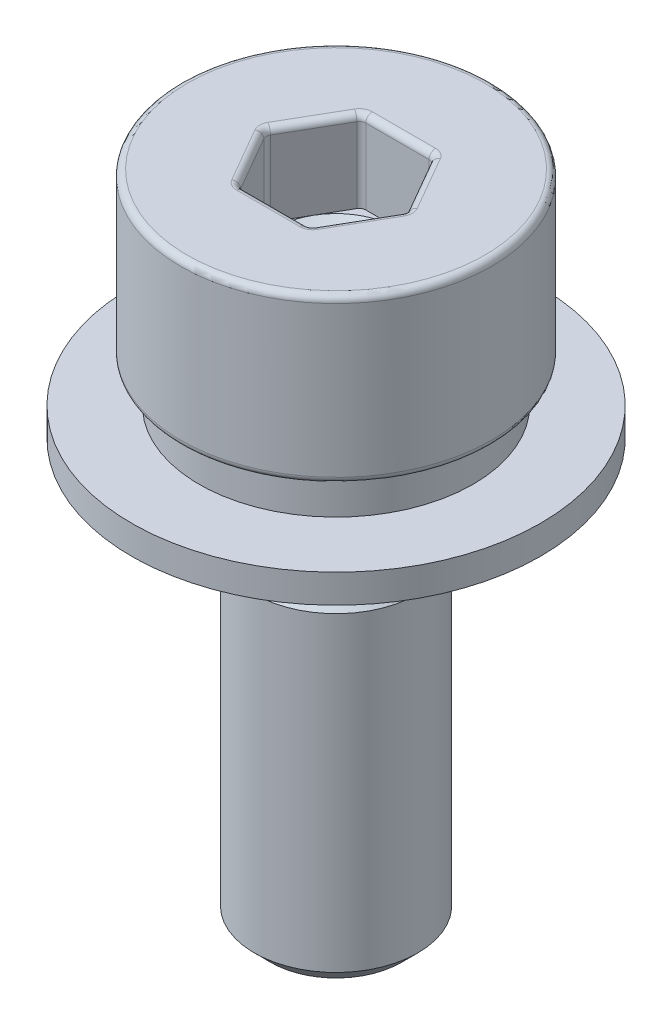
ISO-10303-21;
HEADER;
FILE_DESCRIPTION(('STEP AP214'),'2;1');
FILE_NAME('part.step','',(''),(''),'','','');
FILE_SCHEMA(('AUTOMOTIVE_DESIGN { 1 0 10303 214 1 1 1 1 }'));
ENDSEC;
DATA;
#1=APPLICATION_CONTEXT('core data for automotive mechanical design processes');
#2=APPLICATION_PROTOCOL_DEFINITION('international standard','automotive_design',2000,#1);
#3=PRODUCT_CONTEXT('',#1,'mechanical');
#4=PRODUCT('Part','Part','',(#3));
#5=PRODUCT_RELATED_PRODUCT_CATEGORY('part','',(#4));
#6=PRODUCT_DEFINITION_FORMATION('','',#4);
#7=PRODUCT_DEFINITION_CONTEXT('part definition',#1,'design');
#8=PRODUCT_DEFINITION('design','',#6,#7);
#9=PRODUCT_DEFINITION_SHAPE('','',#8);
#10=(LENGTH_UNIT() NAMED_UNIT(*) SI_UNIT(.MILLI.,.METRE.));
#11=(NAMED_UNIT(*) PLANE_ANGLE_UNIT() SI_UNIT($,.RADIAN.));
#12=(NAMED_UNIT(*) SI_UNIT($,.STERADIAN.) SOLID_ANGLE_UNIT());
#13=UNCERTAINTY_MEASURE_WITH_UNIT(LENGTH_MEASURE(1.E-05),#10,'distance_accuracy_value','');
#14=(GEOMETRIC_REPRESENTATION_CONTEXT(3) GLOBAL_UNCERTAINTY_ASSIGNED_CONTEXT((#13)) GLOBAL_UNIT_ASSIGNED_CONTEXT((#10,
#11,#12)) REPRESENTATION_CONTEXT('',''));
#15=CARTESIAN_POINT('',(0.,0.,0.));
#16=DIRECTION('',(0.,0.,1.));
#17=DIRECTION('',(1.,0.,0.));
#18=AXIS2_PLACEMENT_3D('',#15,#16,#17);
#19=CARTESIAN_POINT('',(1.9,-2.,0.));
#20=DIRECTION('',(0.,-1.,0.));
#21=DIRECTION('',(1.,0.,0.));
#22=AXIS2_PLACEMENT_3D('',#19,#20,#21);
#23=PLANE('',#22);
#24=CARTESIAN_POINT('',(0.,-2.00000000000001,0.));
#25=DIRECTION('',(0.,-1.,0.));
#26=DIRECTION('',(1.,0.,0.));
#27=AXIS2_PLACEMENT_3D('',#24,#25,#26);
#28=CIRCLE('',#27,1.82);
#29=CARTESIAN_POINT('',(1.82,-2.,0.));
#30=VERTEX_POINT('',#29);
#31=EDGE_CURVE('E354',#30,#30,#28,.T.);
#32=ORIENTED_EDGE('',*,*,#31,.T.);
#33=EDGE_LOOP('',(#32));
#34=FACE_BOUND('',#33,.T.);
#35=DIRECTION('',(1.,0.,0.));
#36=VECTOR('',#35,1.);
#37=CARTESIAN_POINT('',(-1.9,-2.,0.0461753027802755));
#38=LINE('',#37,#36);
#39=CARTESIAN_POINT('',(-1.67436341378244,-2.00000000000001,0.0461753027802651));
#40=VERTEX_POINT('',#39);
#41=CARTESIAN_POINT('',(-0.873780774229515,-2.,0.0461753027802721));
#42=VERTEX_POINT('',#41);
#43=EDGE_CURVE('E647',#40,#42,#38,.T.);
#44=ORIENTED_EDGE('',*,*,#43,.F.);
#45=CARTESIAN_POINT('',(0.,-2.00000000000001,0.));
#46=DIRECTION('',(0.,-1.,0.));
#47=DIRECTION('',(1.,0.,0.));
#48=AXIS2_PLACEMENT_3D('',#45,#46,#47);
#49=CIRCLE('',#48,1.675);
#50=CARTESIAN_POINT('',(-1.66255240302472,-2.00000000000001,-0.203824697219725));
#51=VERTEX_POINT('',#50);
#52=EDGE_CURVE('E223',#51,#40,#49,.T.);
#53=ORIENTED_EDGE('',*,*,#52,.F.);
#54=DIRECTION('',(1.,0.,0.));
#55=VECTOR('',#54,1.);
#56=CARTESIAN_POINT('',(-1.9,-2.00000000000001,-0.203824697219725));
#57=LINE('',#56,#55);
#58=CARTESIAN_POINT('',(-0.850929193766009,-2.,-0.203824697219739));
#59=VERTEX_POINT('',#58);
#60=EDGE_CURVE('E650',#51,#59,#57,.T.);
#61=ORIENTED_EDGE('',*,*,#60,.T.);
#62=CARTESIAN_POINT('',(0.,-2.00000000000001,0.));
#63=DIRECTION('',(0.,-1.,0.));
#64=DIRECTION('',(1.,0.,0.));
#65=AXIS2_PLACEMENT_3D('',#62,#63,#64);
#66=CIRCLE('',#65,0.875);
#67=EDGE_CURVE('E13',#42,#59,#66,.F.);
#68=ORIENTED_EDGE('',*,*,#67,.F.);
#69=EDGE_LOOP('',(#44,#53,#61,#68));
#70=FACE_BOUND('',#69,.T.);
#71=CARTESIAN_POINT('',(0.,-2.,0.));
#72=DIRECTION('',(0.,-1.,0.));
#73=DIRECTION('',(1.,0.,0.));
#74=AXIS2_PLACEMENT_3D('',#71,#72,#73);
#75=CIRCLE('',#74,0.799999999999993);
#76=CARTESIAN_POINT('',(0.799999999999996,-2.,0.));
#77=VERTEX_POINT('',#76);
#78=EDGE_CURVE('E271',#77,#77,#75,.T.);
#79=ORIENTED_EDGE('',*,*,#78,.F.);
#80=EDGE_LOOP('',(#79));
#81=FACE_BOUND('',#80,.T.);
#82=ADVANCED_FACE('F45',(#34,#70,#81),#23,.T.);
#83=CARTESIAN_POINT('',(2.42861286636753E-13,-71.2230936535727,0.));
#84=DIRECTION('',(0.,-1.,0.));
#85=DIRECTION('',(1.,0.,0.));
#86=AXIS2_PLACEMENT_3D('',#83,#84,#85);
#87=CYLINDRICAL_SURFACE('',#86,1.9);
#88=CARTESIAN_POINT('',(0.,-0.0799999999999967,0.));
#89=DIRECTION('',(0.,1.,0.));
#90=DIRECTION('',(-1.,0.,0.));
#91=AXIS2_PLACEMENT_3D('',#88,#89,#90);
#92=CIRCLE('',#91,1.9);
#93=CARTESIAN_POINT('',(-1.9,-0.0800000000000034,0.));
#94=VERTEX_POINT('',#93);
#95=EDGE_CURVE('E351',#94,#94,#92,.F.);
#96=ORIENTED_EDGE('',*,*,#95,.T.);
#97=EDGE_LOOP('',(#96));
#98=FACE_BOUND('',#97,.T.);
#99=CARTESIAN_POINT('',(0.,-1.92000000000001,0.));
#100=DIRECTION('',(0.,-1.,0.));
#101=DIRECTION('',(1.,0.,0.));
#102=AXIS2_PLACEMENT_3D('',#99,#100,#101);
#103=CIRCLE('',#102,1.9);
#104=CARTESIAN_POINT('',(1.9,-1.92,0.));
#105=VERTEX_POINT('',#104);
#106=EDGE_CURVE('E348',#105,#105,#103,.F.);
#107=ORIENTED_EDGE('',*,*,#106,.T.);
#108=EDGE_LOOP('',(#107));
#109=FACE_BOUND('',#108,.T.);
#110=ADVANCED_FACE('F442',(#98,#109),#87,.T.);
#111=CARTESIAN_POINT('',(0.749999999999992,0.,0.));
#112=DIRECTION('',(0.,1.,0.));
#113=DIRECTION('',(-1.,0.,0.));
#114=AXIS2_PLACEMENT_3D('',#111,#112,#113);
#115=PLANE('',#114);
#116=CARTESIAN_POINT('',(0.386824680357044,0.,-0.669999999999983));
#117=DIRECTION('',(0.,1.,0.));
#118=DIRECTION('',(-1.,0.,0.));
#119=AXIS2_PLACEMENT_3D('',#116,#117,#118);
#120=CIRCLE('',#119,0.16);
#121=CARTESIAN_POINT('',(0.52538874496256,0.,-0.749999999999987));
#122=VERTEX_POINT('',#121);
#123=CARTESIAN_POINT('',(0.386824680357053,0.,-0.829999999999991));
#124=VERTEX_POINT('',#123);
#125=EDGE_CURVE('E311',#122,#124,#120,.T.);
#126=ORIENTED_EDGE('',*,*,#125,.F.);
#127=DIRECTION('',(-0.5,0.,-0.866025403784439));
#128=VECTOR('',#127,1.);
#129=CARTESIAN_POINT('',(0.93530743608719,0.,-0.0399999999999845));
#130=LINE('',#129,#128);
#131=CARTESIAN_POINT('',(0.912213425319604,0.,-0.0799999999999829));
#132=VERTEX_POINT('',#131);
#133=EDGE_CURVE('E317',#122,#132,#130,.F.);
#134=ORIENTED_EDGE('',*,*,#133,.T.);
#135=CARTESIAN_POINT('',(0.773649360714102,0.,0.));
#136=DIRECTION('',(0.,1.,0.));
#137=DIRECTION('',(-1.,0.,0.));
#138=AXIS2_PLACEMENT_3D('',#135,#136,#137);
#139=CIRCLE('',#138,0.16);
#140=CARTESIAN_POINT('',(0.912213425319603,0.,0.0800000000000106));
#141=VERTEX_POINT('',#140);
#142=EDGE_CURVE('E314',#141,#132,#139,.T.);
#143=ORIENTED_EDGE('',*,*,#142,.F.);
#144=DIRECTION('',(0.500000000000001,0.,-0.86602540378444));
#145=VECTOR('',#144,1.);
#146=CARTESIAN_POINT('',(0.502294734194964,0.,0.790000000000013));
#147=LINE('',#146,#145);
#148=CARTESIAN_POINT('',(0.525388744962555,0.,0.750000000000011));
#149=VERTEX_POINT('',#148);
#150=EDGE_CURVE('E309',#141,#149,#147,.F.);
#151=ORIENTED_EDGE('',*,*,#150,.T.);
#152=CARTESIAN_POINT('',(0.386824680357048,0.,0.670000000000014));
#153=DIRECTION('',(0.,1.,0.));
#154=DIRECTION('',(-1.,0.,0.));
#155=AXIS2_PLACEMENT_3D('',#152,#153,#154);
#156=CIRCLE('',#155,0.16);
#157=CARTESIAN_POINT('',(0.386824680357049,0.,0.829999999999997));
#158=VERTEX_POINT('',#157);
#159=EDGE_CURVE('E306',#158,#149,#156,.T.);
#160=ORIENTED_EDGE('',*,*,#159,.F.);
#161=DIRECTION('',(1.,0.,0.));
#162=VECTOR('',#161,1.);
#163=CARTESIAN_POINT('',(-0.433012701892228,0.,0.830000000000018));
#164=LINE('',#163,#162);
#165=CARTESIAN_POINT('',(-0.386824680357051,0.,0.830000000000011));
#166=VERTEX_POINT('',#165);
#167=EDGE_CURVE('E298',#158,#166,#164,.F.);
#168=ORIENTED_EDGE('',*,*,#167,.T.);
#169=CARTESIAN_POINT('',(-0.386824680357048,0.,0.670000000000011));
#170=DIRECTION('',(0.,1.,0.));
#171=DIRECTION('',(-1.,0.,0.));
#172=AXIS2_PLACEMENT_3D('',#169,#170,#171);
#173=CIRCLE('',#172,0.16);
#174=CARTESIAN_POINT('',(-0.525388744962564,0.,0.750000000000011));
#175=VERTEX_POINT('',#174);
#176=EDGE_CURVE('E295',#175,#166,#173,.T.);
#177=ORIENTED_EDGE('',*,*,#176,.F.);
#178=DIRECTION('',(0.500000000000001,0.,0.866025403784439));
#179=VECTOR('',#178,1.);
#180=CARTESIAN_POINT('',(-0.935307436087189,0.,0.0400000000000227));
#181=LINE('',#180,#179);
#182=CARTESIAN_POINT('',(-0.912213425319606,0.,0.0800000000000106));
#183=VERTEX_POINT('',#182);
#184=EDGE_CURVE('E291',#175,#183,#181,.F.);
#185=ORIENTED_EDGE('',*,*,#184,.T.);
#186=CARTESIAN_POINT('',(-0.773649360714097,0.,0.));
#187=DIRECTION('',(0.,1.,0.));
#188=DIRECTION('',(-1.,0.,0.));
#189=AXIS2_PLACEMENT_3D('',#186,#187,#188);
#190=CIRCLE('',#189,0.16);
#191=CARTESIAN_POINT('',(-0.912213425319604,0.,-0.0799999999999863));
#192=VERTEX_POINT('',#191);
#193=EDGE_CURVE('E288',#192,#183,#190,.T.);
#194=ORIENTED_EDGE('',*,*,#193,.F.);
#195=DIRECTION('',(-0.500000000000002,0.,0.86602540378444));
#196=VECTOR('',#195,1.);
#197=CARTESIAN_POINT('',(-0.502294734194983,0.,-0.789999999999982));
#198=LINE('',#197,#196);
#199=CARTESIAN_POINT('',(-0.525388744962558,0.,-0.74999999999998));
#200=VERTEX_POINT('',#199);
#201=EDGE_CURVE('E293',#192,#200,#198,.F.);
#202=ORIENTED_EDGE('',*,*,#201,.T.);
#203=CARTESIAN_POINT('',(-0.386824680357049,0.,-0.66999999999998));
#204=DIRECTION('',(0.,1.,0.));
#205=DIRECTION('',(-1.,0.,0.));
#206=AXIS2_PLACEMENT_3D('',#203,#204,#205);
#207=CIRCLE('',#206,0.16);
#208=CARTESIAN_POINT('',(-0.386824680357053,0.,-0.829999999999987));
#209=VERTEX_POINT('',#208);
#210=EDGE_CURVE('E301',#209,#200,#207,.T.);
#211=ORIENTED_EDGE('',*,*,#210,.F.);
#212=DIRECTION('',(-1.,0.,0.));
#213=VECTOR('',#212,1.);
#214=CARTESIAN_POINT('',(0.433012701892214,0.,-0.829999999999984));
#215=LINE('',#214,#213);
#216=EDGE_CURVE('E304',#209,#124,#215,.F.);
#217=ORIENTED_EDGE('',*,*,#216,.T.);
#218=EDGE_LOOP('',(#126,#134,#143,#151,#160,#168,#177,#185,#194,#202,#211,#217));
#219=FACE_BOUND('',#218,.T.);
#220=CARTESIAN_POINT('',(0.,0.,0.));
#221=DIRECTION('',(0.,1.,0.));
#222=DIRECTION('',(-1.,0.,0.));
#223=AXIS2_PLACEMENT_3D('',#220,#221,#222);
#224=CIRCLE('',#223,1.82);
#225=CARTESIAN_POINT('',(-1.82,0.,0.));
#226=VERTEX_POINT('',#225);
#227=EDGE_CURVE('E285',#226,#226,#224,.T.);
#228=ORIENTED_EDGE('',*,*,#227,.T.);
#229=EDGE_LOOP('',(#228));
#230=FACE_BOUND('',#229,.T.);
#231=ADVANCED_FACE('F448',(#219,#230),#115,.T.);
#232=CARTESIAN_POINT('',(0.433012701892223,-1.,0.750000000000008));
#233=DIRECTION('',(0.86602540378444,0.,0.499999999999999));
#234=DIRECTION('',(0.500000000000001,0.,-0.86602540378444));
#235=AXIS2_PLACEMENT_3D('',#232,#233,#234);
#236=PLANE('',#235);
#237=DIRECTION('',(0.500000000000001,0.,-0.86602540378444));
#238=VECTOR('',#237,1.);
#239=CARTESIAN_POINT('',(0.433012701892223,-1.,0.750000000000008));
#240=LINE('',#239,#238);
#241=CARTESIAN_POINT('',(0.456106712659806,-1.,0.710000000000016));
#242=VERTEX_POINT('',#241);
#243=CARTESIAN_POINT('',(0.649519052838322,-0.999999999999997,0.375000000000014));
#244=VERTEX_POINT('',#243);
#245=EDGE_CURVE('E246',#242,#244,#240,.T.);
#246=ORIENTED_EDGE('',*,*,#245,.F.);
#247=DIRECTION('',(0.,1.,0.));
#248=VECTOR('',#247,1.);
#249=CARTESIAN_POINT('',(0.456106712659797,0.,0.710000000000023));
#250=LINE('',#249,#248);
#251=CARTESIAN_POINT('',(0.456106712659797,-0.0800000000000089,0.710000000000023));
#252=VERTEX_POINT('',#251);
#253=EDGE_CURVE('E323',#242,#252,#250,.T.);
#254=ORIENTED_EDGE('',*,*,#253,.T.);
#255=DIRECTION('',(0.500000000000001,0.,-0.86602540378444));
#256=VECTOR('',#255,1.);
#257=CARTESIAN_POINT('',(0.866025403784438,-0.0800000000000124,0.));
#258=LINE('',#257,#256);
#259=CARTESIAN_POINT('',(0.842931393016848,-0.0800000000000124,0.0400000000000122));
#260=VERTEX_POINT('',#259);
#261=EDGE_CURVE('E321',#252,#260,#258,.T.);
#262=ORIENTED_EDGE('',*,*,#261,.T.);
#263=DIRECTION('',(0.,1.,0.));
#264=VECTOR('',#263,1.);
#265=CARTESIAN_POINT('',(0.842931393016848,-1.00000000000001,0.0400000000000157));
#266=LINE('',#265,#264);
#267=CARTESIAN_POINT('',(0.842931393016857,-1.00000000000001,0.0400000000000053));
#268=VERTEX_POINT('',#267);
#269=EDGE_CURVE('E319',#260,#268,#266,.F.);
#270=ORIENTED_EDGE('',*,*,#269,.T.);
#271=EDGE_CURVE('E249',#244,#268,#240,.T.);
#272=ORIENTED_EDGE('',*,*,#271,.F.);
#273=EDGE_LOOP('',(#246,#254,#262,#270,#272));
#274=FACE_BOUND('',#273,.T.);
#275=ADVANCED_FACE('F563',(#274),#236,.F.);
#276=CARTESIAN_POINT('',(-0.433012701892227,-1.,0.750000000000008));
#277=DIRECTION('',(0.,0.,1.));
#278=DIRECTION('',(1.,0.,0.));
#279=AXIS2_PLACEMENT_3D('',#276,#277,#278);
#280=PLANE('',#279);
#281=DIRECTION('',(1.,0.,0.));
#282=VECTOR('',#281,1.);
#283=CARTESIAN_POINT('',(-0.433012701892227,-1.,0.750000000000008));
#284=LINE('',#283,#282);
#285=CARTESIAN_POINT('',(-0.386824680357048,-1.,0.750000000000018));
#286=VERTEX_POINT('',#285);
#287=CARTESIAN_POINT('',(0.,-0.999999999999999,0.750000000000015));
#288=VERTEX_POINT('',#287);
#289=EDGE_CURVE('E262',#286,#288,#284,.T.);
#290=ORIENTED_EDGE('',*,*,#289,.F.);
#291=DIRECTION('',(0.,1.,0.));
#292=VECTOR('',#291,1.);
#293=CARTESIAN_POINT('',(-0.386824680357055,0.,0.750000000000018));
#294=LINE('',#293,#292);
#295=CARTESIAN_POINT('',(-0.386824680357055,-0.0800000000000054,0.750000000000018));
#296=VERTEX_POINT('',#295);
#297=EDGE_CURVE('E283',#286,#296,#294,.T.);
#298=ORIENTED_EDGE('',*,*,#297,.T.);
#299=DIRECTION('',(1.,0.,0.));
#300=VECTOR('',#299,1.);
#301=CARTESIAN_POINT('',(0.433012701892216,-0.0800000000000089,0.750000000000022));
#302=LINE('',#301,#300);
#303=CARTESIAN_POINT('',(0.386824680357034,-0.0800000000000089,0.750000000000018));
#304=VERTEX_POINT('',#303);
#305=EDGE_CURVE('E280',#296,#304,#302,.T.);
#306=ORIENTED_EDGE('',*,*,#305,.T.);
#307=DIRECTION('',(0.,1.,0.));
#308=VECTOR('',#307,1.);
#309=CARTESIAN_POINT('',(0.386824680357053,-1.,0.749999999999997));
#310=LINE('',#309,#308);
#311=CARTESIAN_POINT('',(0.386824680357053,-1.,0.749999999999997));
#312=VERTEX_POINT('',#311);
#313=EDGE_CURVE('E278',#304,#312,#310,.F.);
#314=ORIENTED_EDGE('',*,*,#313,.T.);
#315=EDGE_CURVE('E261',#288,#312,#284,.T.);
#316=ORIENTED_EDGE('',*,*,#315,.F.);
#317=EDGE_LOOP('',(#290,#298,#306,#314,#316));
#318=FACE_BOUND('',#317,.T.);
#319=ADVANCED_FACE('F559',(#318),#280,.F.);
#320=CARTESIAN_POINT('',(-0.866025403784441,-0.999999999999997,0.));
#321=DIRECTION('',(-0.866025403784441,0.,0.500000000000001));
#322=DIRECTION('',(0.500000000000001,0.,0.866025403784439));
#323=AXIS2_PLACEMENT_3D('',#320,#321,#322);
#324=PLANE('',#323);
#325=DIRECTION('',(0.500000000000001,0.,0.866025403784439));
#326=VECTOR('',#325,1.);
#327=CARTESIAN_POINT('',(-0.866025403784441,-0.999999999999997,0.));
#328=LINE('',#327,#326);
#329=CARTESIAN_POINT('',(-0.842931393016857,-1.,0.0400000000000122));
#330=VERTEX_POINT('',#329);
#331=CARTESIAN_POINT('',(-0.64951905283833,-1.00000000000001,0.375000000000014));
#332=VERTEX_POINT('',#331);
#333=EDGE_CURVE('E259',#330,#332,#328,.T.);
#334=ORIENTED_EDGE('',*,*,#333,.F.);
#335=DIRECTION('',(0.,1.,0.));
#336=VECTOR('',#335,1.);
#337=CARTESIAN_POINT('',(-0.84293139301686,0.,0.0400000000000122));
#338=LINE('',#337,#336);
#339=CARTESIAN_POINT('',(-0.84293139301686,-0.0800000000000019,0.0400000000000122));
#340=VERTEX_POINT('',#339);
#341=EDGE_CURVE('E68',#330,#340,#338,.T.);
#342=ORIENTED_EDGE('',*,*,#341,.T.);
#343=DIRECTION('',(0.500000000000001,0.,0.866025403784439));
#344=VECTOR('',#343,1.);
#345=CARTESIAN_POINT('',(-0.43301270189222,-0.0800000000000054,0.749999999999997));
#346=LINE('',#345,#344);
#347=CARTESIAN_POINT('',(-0.456106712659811,-0.0800000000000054,0.710000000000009));
#348=VERTEX_POINT('',#347);
#349=EDGE_CURVE('E345',#340,#348,#346,.T.);
#350=ORIENTED_EDGE('',*,*,#349,.T.);
#351=DIRECTION('',(0.,1.,0.));
#352=VECTOR('',#351,1.);
#353=CARTESIAN_POINT('',(-0.456106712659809,-1.,0.710000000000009));
#354=LINE('',#353,#352);
#355=CARTESIAN_POINT('',(-0.456106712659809,-1.,0.710000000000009));
#356=VERTEX_POINT('',#355);
#357=EDGE_CURVE('E343',#348,#356,#354,.F.);
#358=ORIENTED_EDGE('',*,*,#357,.T.);
#359=EDGE_CURVE('E258',#332,#356,#328,.T.);
#360=ORIENTED_EDGE('',*,*,#359,.F.);
#361=EDGE_LOOP('',(#334,#342,#350,#358,#360));
#362=FACE_BOUND('',#361,.T.);
#363=ADVANCED_FACE('F562',(#362),#324,.F.);
#364=CARTESIAN_POINT('',(-0.433012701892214,-0.999999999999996,-0.74999999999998));
#365=DIRECTION('',(-0.86602540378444,0.,-0.5));
#366=DIRECTION('',(-0.500000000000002,0.,0.86602540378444));
#367=AXIS2_PLACEMENT_3D('',#364,#365,#366);
#368=PLANE('',#367);
#369=DIRECTION('',(-0.500000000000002,0.,0.86602540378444));
#370=VECTOR('',#369,1.);
#371=CARTESIAN_POINT('',(-0.866025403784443,-0.0800000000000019,0.));
#372=LINE('',#371,#370);
#373=CARTESIAN_POINT('',(-0.456106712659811,-0.0800000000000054,-0.709999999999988));
#374=VERTEX_POINT('',#373);
#375=CARTESIAN_POINT('',(-0.842931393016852,-0.0800000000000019,-0.0399999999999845));
#376=VERTEX_POINT('',#375);
#377=EDGE_CURVE('E339',#374,#376,#372,.T.);
#378=ORIENTED_EDGE('',*,*,#377,.T.);
#379=DIRECTION('',(0.,1.,0.));
#380=VECTOR('',#379,1.);
#381=CARTESIAN_POINT('',(-0.842931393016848,-1.,-0.0399999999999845));
#382=LINE('',#381,#380);
#383=CARTESIAN_POINT('',(-0.842931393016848,-1.,-0.0399999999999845));
#384=VERTEX_POINT('',#383);
#385=EDGE_CURVE('E341',#376,#384,#382,.F.);
#386=ORIENTED_EDGE('',*,*,#385,.T.);
#387=DIRECTION('',(-0.500000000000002,0.,0.86602540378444));
#388=VECTOR('',#387,1.);
#389=CARTESIAN_POINT('',(-0.433012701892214,-0.999999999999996,-0.74999999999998));
#390=LINE('',#389,#388);
#391=CARTESIAN_POINT('',(-0.64951905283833,-1.00000000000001,-0.37499999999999));
#392=VERTEX_POINT('',#391);
#393=EDGE_CURVE('E255',#392,#384,#390,.T.);
#394=ORIENTED_EDGE('',*,*,#393,.F.);
#395=CARTESIAN_POINT('',(-0.456106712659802,-1.,-0.709999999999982));
#396=VERTEX_POINT('',#395);
#397=EDGE_CURVE('E256',#396,#392,#390,.T.);
#398=ORIENTED_EDGE('',*,*,#397,.F.);
#399=DIRECTION('',(0.,1.,0.));
#400=VECTOR('',#399,1.);
#401=CARTESIAN_POINT('',(-0.456106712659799,0.,-0.709999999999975));
#402=LINE('',#401,#400);
#403=EDGE_CURVE('E337',#396,#374,#402,.T.);
#404=ORIENTED_EDGE('',*,*,#403,.T.);
#405=EDGE_LOOP('',(#378,#386,#394,#398,#404));
#406=FACE_BOUND('',#405,.T.);
#407=ADVANCED_FACE('F567',(#406),#368,.F.);
#408=CARTESIAN_POINT('',(0.433012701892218,-1.,-0.749999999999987));
#409=DIRECTION('',(0.,0.,-1.));
#410=DIRECTION('',(-1.,0.,0.));
#411=AXIS2_PLACEMENT_3D('',#408,#409,#410);
#412=PLANE('',#411);
#413=DIRECTION('',(-1.,0.,0.));
#414=VECTOR('',#413,1.);
#415=CARTESIAN_POINT('',(-0.433012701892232,-0.0800000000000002,-0.749999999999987));
#416=LINE('',#415,#414);
#417=CARTESIAN_POINT('',(0.386824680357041,-0.0800000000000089,-0.749999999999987));
#418=VERTEX_POINT('',#417);
#419=CARTESIAN_POINT('',(-0.386824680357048,-0.079999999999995,-0.749999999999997));
#420=VERTEX_POINT('',#419);
#421=EDGE_CURVE('E333',#418,#420,#416,.T.);
#422=ORIENTED_EDGE('',*,*,#421,.T.);
#423=DIRECTION('',(0.,1.,0.));
#424=VECTOR('',#423,1.);
#425=CARTESIAN_POINT('',(-0.386824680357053,-0.99999999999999,-0.74999999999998));
#426=LINE('',#425,#424);
#427=CARTESIAN_POINT('',(-0.386824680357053,-0.99999999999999,-0.74999999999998));
#428=VERTEX_POINT('',#427);
#429=EDGE_CURVE('E335',#420,#428,#426,.F.);
#430=ORIENTED_EDGE('',*,*,#429,.T.);
#431=DIRECTION('',(-1.,0.,0.));
#432=VECTOR('',#431,1.);
#433=CARTESIAN_POINT('',(0.433012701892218,-1.,-0.749999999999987));
#434=LINE('',#433,#432);
#435=CARTESIAN_POINT('',(0.,-1.,-0.749999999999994));
#436=VERTEX_POINT('',#435);
#437=EDGE_CURVE('E252',#436,#428,#434,.T.);
#438=ORIENTED_EDGE('',*,*,#437,.F.);
#439=CARTESIAN_POINT('',(0.386824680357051,-1.,-0.749999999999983));
#440=VERTEX_POINT('',#439);
#441=EDGE_CURVE('E253',#440,#436,#434,.T.);
#442=ORIENTED_EDGE('',*,*,#441,.F.);
#443=DIRECTION('',(0.,1.,0.));
#444=VECTOR('',#443,1.);
#445=CARTESIAN_POINT('',(0.386824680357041,0.,-0.749999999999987));
#446=LINE('',#445,#444);
#447=EDGE_CURVE('E331',#440,#418,#446,.T.);
#448=ORIENTED_EDGE('',*,*,#447,.T.);
#449=EDGE_LOOP('',(#422,#430,#438,#442,#448));
#450=FACE_BOUND('',#449,.T.);
#451=ADVANCED_FACE('F570',(#450),#412,.F.);
#452=CARTESIAN_POINT('',(0.866025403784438,-1.00000000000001,0.));
#453=DIRECTION('',(0.866025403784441,0.,-0.500000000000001));
#454=DIRECTION('',(-0.5,0.,-0.866025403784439));
#455=AXIS2_PLACEMENT_3D('',#452,#453,#454);
#456=PLANE('',#455);
#457=DIRECTION('',(-0.5,0.,-0.866025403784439));
#458=VECTOR('',#457,1.);
#459=CARTESIAN_POINT('',(0.866025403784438,-1.00000000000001,0.));
#460=LINE('',#459,#458);
#461=CARTESIAN_POINT('',(0.84293139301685,-1.00000000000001,-0.0399999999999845));
#462=VERTEX_POINT('',#461);
#463=CARTESIAN_POINT('',(0.649519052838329,-0.999999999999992,-0.374999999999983));
#464=VERTEX_POINT('',#463);
#465=EDGE_CURVE('E250',#462,#464,#460,.T.);
#466=ORIENTED_EDGE('',*,*,#465,.F.);
#467=DIRECTION('',(0.,1.,0.));
#468=VECTOR('',#467,1.);
#469=CARTESIAN_POINT('',(0.842931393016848,0.,-0.0399999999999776));
#470=LINE('',#469,#468);
#471=CARTESIAN_POINT('',(0.842931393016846,-0.0800000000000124,-0.039999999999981));
#472=VERTEX_POINT('',#471);
#473=EDGE_CURVE('E329',#462,#472,#470,.T.);
#474=ORIENTED_EDGE('',*,*,#473,.T.);
#475=DIRECTION('',(-0.5,0.,-0.866025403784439));
#476=VECTOR('',#475,1.);
#477=CARTESIAN_POINT('',(0.433012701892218,-0.0800000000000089,-0.749999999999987));
#478=LINE('',#477,#476);
#479=CARTESIAN_POINT('',(0.456106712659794,-0.0800000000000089,-0.709999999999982));
#480=VERTEX_POINT('',#479);
#481=EDGE_CURVE('E327',#472,#480,#478,.T.);
#482=ORIENTED_EDGE('',*,*,#481,.T.);
#483=DIRECTION('',(0.,1.,0.));
#484=VECTOR('',#483,1.);
#485=CARTESIAN_POINT('',(0.456106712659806,-1.,-0.709999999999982));
#486=LINE('',#485,#484);
#487=CARTESIAN_POINT('',(0.456106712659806,-1.,-0.709999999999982));
#488=VERTEX_POINT('',#487);
#489=EDGE_CURVE('E325',#480,#488,#486,.F.);
#490=ORIENTED_EDGE('',*,*,#489,.T.);
#491=EDGE_CURVE('E248',#464,#488,#460,.T.);
#492=ORIENTED_EDGE('',*,*,#491,.F.);
#493=EDGE_LOOP('',(#466,#474,#482,#490,#492));
#494=FACE_BOUND('',#493,.T.);
#495=ADVANCED_FACE('F574',(#494),#456,.F.);
#496=CARTESIAN_POINT('',(0.,-0.999999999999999,0.));
#497=DIRECTION('',(0.,1.,0.));
#498=DIRECTION('',(-1.,0.,0.));
#499=AXIS2_PLACEMENT_3D('',#496,#497,#498);
#500=PLANE('',#499);
#501=ORIENTED_EDGE('',*,*,#359,.T.);
#502=CARTESIAN_POINT('',(-0.386824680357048,-1.,0.670000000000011));
#503=DIRECTION('',(0.,1.,0.));
#504=DIRECTION('',(-1.,0.,0.));
#505=AXIS2_PLACEMENT_3D('',#502,#503,#504);
#506=CIRCLE('',#505,0.08);
#507=EDGE_CURVE('E361',#356,#286,#506,.T.);
#508=ORIENTED_EDGE('',*,*,#507,.T.);
#509=ORIENTED_EDGE('',*,*,#289,.T.);
#510=CARTESIAN_POINT('',(0.,-1.,0.));
#511=DIRECTION('',(0.,-1.,0.));
#512=DIRECTION('',(1.,0.,0.));
#513=AXIS2_PLACEMENT_3D('',#510,#511,#512);
#514=CIRCLE('',#513,0.749999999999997);
#515=EDGE_CURVE('E272',#288,#332,#514,.T.);
#516=ORIENTED_EDGE('',*,*,#515,.T.);
#517=EDGE_LOOP('',(#501,#508,#509,#516));
#518=FACE_BOUND('',#517,.T.);
#519=ADVANCED_FACE('F558',(#518),#500,.T.);
#520=ORIENTED_EDGE('',*,*,#315,.T.);
#521=CARTESIAN_POINT('',(0.386824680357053,-1.,0.670000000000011));
#522=DIRECTION('',(0.,1.,0.));
#523=DIRECTION('',(-1.,0.,0.));
#524=AXIS2_PLACEMENT_3D('',#521,#522,#523);
#525=CIRCLE('',#524,0.08);
#526=EDGE_CURVE('E363',#312,#242,#525,.T.);
#527=ORIENTED_EDGE('',*,*,#526,.T.);
#528=ORIENTED_EDGE('',*,*,#245,.T.);
#529=EDGE_CURVE('E268',#244,#288,#514,.T.);
#530=ORIENTED_EDGE('',*,*,#529,.T.);
#531=EDGE_LOOP('',(#520,#527,#528,#530));
#532=FACE_BOUND('',#531,.T.);
#533=ADVANCED_FACE('F799',(#532),#500,.T.);
#534=ORIENTED_EDGE('',*,*,#271,.T.);
#535=CARTESIAN_POINT('',(0.773649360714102,-1.00000000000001,0.));
#536=DIRECTION('',(0.,1.,0.));
#537=DIRECTION('',(-1.,0.,0.));
#538=AXIS2_PLACEMENT_3D('',#535,#536,#537);
#539=CIRCLE('',#538,0.08);
#540=EDGE_CURVE('E365',#268,#462,#539,.T.);
#541=ORIENTED_EDGE('',*,*,#540,.T.);
#542=ORIENTED_EDGE('',*,*,#465,.T.);
#543=EDGE_CURVE('E267',#464,#244,#514,.T.);
#544=ORIENTED_EDGE('',*,*,#543,.T.);
#545=EDGE_LOOP('',(#534,#541,#542,#544));
#546=FACE_BOUND('',#545,.T.);
#547=ADVANCED_FACE('F792',(#546),#500,.T.);
#548=ORIENTED_EDGE('',*,*,#491,.T.);
#549=CARTESIAN_POINT('',(0.386824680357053,-1.,-0.669999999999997));
#550=DIRECTION('',(0.,1.,0.));
#551=DIRECTION('',(-1.,0.,0.));
#552=AXIS2_PLACEMENT_3D('',#549,#550,#551);
#553=CIRCLE('',#552,0.08);
#554=EDGE_CURVE('E367',#488,#440,#553,.T.);
#555=ORIENTED_EDGE('',*,*,#554,.T.);
#556=ORIENTED_EDGE('',*,*,#441,.T.);
#557=EDGE_CURVE('E865',#436,#464,#514,.T.);
#558=ORIENTED_EDGE('',*,*,#557,.T.);
#559=EDGE_LOOP('',(#548,#555,#556,#558));
#560=FACE_BOUND('',#559,.T.);
#561=ADVANCED_FACE('F785',(#560),#500,.T.);
#562=ORIENTED_EDGE('',*,*,#437,.T.);
#563=CARTESIAN_POINT('',(-0.386824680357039,-0.999999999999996,-0.669999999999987));
#564=DIRECTION('',(0.,1.,0.));
#565=DIRECTION('',(-1.,0.,0.));
#566=AXIS2_PLACEMENT_3D('',#563,#564,#565);
#567=CIRCLE('',#566,0.08);
#568=EDGE_CURVE('E359',#428,#396,#567,.T.);
#569=ORIENTED_EDGE('',*,*,#568,.T.);
#570=ORIENTED_EDGE('',*,*,#397,.T.);
#571=EDGE_CURVE('E861',#392,#436,#514,.T.);
#572=ORIENTED_EDGE('',*,*,#571,.T.);
#573=EDGE_LOOP('',(#562,#569,#570,#572));
#574=FACE_BOUND('',#573,.T.);
#575=ADVANCED_FACE('F556',(#574),#500,.T.);
#576=ORIENTED_EDGE('',*,*,#393,.T.);
#577=CARTESIAN_POINT('',(-0.773649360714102,-0.999999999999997,0.));
#578=DIRECTION('',(0.,1.,0.));
#579=DIRECTION('',(-1.,0.,0.));
#580=AXIS2_PLACEMENT_3D('',#577,#578,#579);
#581=CIRCLE('',#580,0.08);
#582=EDGE_CURVE('E357',#384,#330,#581,.T.);
#583=ORIENTED_EDGE('',*,*,#582,.T.);
#584=ORIENTED_EDGE('',*,*,#333,.T.);
#585=EDGE_CURVE('E860',#332,#392,#514,.T.);
#586=ORIENTED_EDGE('',*,*,#585,.T.);
#587=EDGE_LOOP('',(#576,#583,#584,#586));
#588=FACE_BOUND('',#587,.T.);
#589=ADVANCED_FACE('F553',(#588),#500,.T.);
#590=CARTESIAN_POINT('',(0.,-1.,0.));
#591=DIRECTION('',(0.,1.,0.));
#592=DIRECTION('',(-1.,0.,0.));
#593=AXIS2_PLACEMENT_3D('',#590,#591,#592);
#594=CONICAL_SURFACE('',#593,0.749999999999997,1.09083078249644);
#595=CARTESIAN_POINT('',(0.,-1.39042528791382,0.));
#596=VERTEX_POINT('',#595);
#597=VERTEX_LOOP('',#596);
#598=FACE_BOUND('',#597,.T.);
#599=ORIENTED_EDGE('',*,*,#529,.F.);
#600=ORIENTED_EDGE('',*,*,#543,.F.);
#601=ORIENTED_EDGE('',*,*,#557,.F.);
#602=ORIENTED_EDGE('',*,*,#571,.F.);
#603=ORIENTED_EDGE('',*,*,#585,.F.);
#604=ORIENTED_EDGE('',*,*,#515,.F.);
#605=EDGE_LOOP('',(#599,#600,#601,#602,#603,#604));
#606=FACE_BOUND('',#605,.T.);
#607=ADVANCED_FACE('F534',(#598,#606),#594,.F.);
#608=CARTESIAN_POINT('',(-0.386824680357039,-0.999999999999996,-0.669999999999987));
#609=DIRECTION('',(0.,-1.,0.));
#610=DIRECTION('',(1.,0.,0.));
#611=AXIS2_PLACEMENT_3D('',#608,#609,#610);
#612=CYLINDRICAL_SURFACE('',#611,0.08);
#613=ORIENTED_EDGE('',*,*,#568,.F.);
#614=ORIENTED_EDGE('',*,*,#429,.F.);
#615=CARTESIAN_POINT('',(-0.386824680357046,-0.0800000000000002,-0.669999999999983));
#616=DIRECTION('',(0.,1.,0.));
#617=DIRECTION('',(-1.,0.,0.));
#618=AXIS2_PLACEMENT_3D('',#615,#616,#617);
#619=CIRCLE('',#618,0.08);
#620=EDGE_CURVE('E413',#374,#420,#619,.F.);
#621=ORIENTED_EDGE('',*,*,#620,.F.);
#622=ORIENTED_EDGE('',*,*,#403,.F.);
#623=EDGE_LOOP('',(#613,#614,#621,#622));
#624=FACE_BOUND('',#623,.T.);
#625=ADVANCED_FACE('F530',(#624),#612,.F.);
#626=CARTESIAN_POINT('',(0.386824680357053,-1.,-0.669999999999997));
#627=DIRECTION('',(0.,-1.,0.));
#628=DIRECTION('',(1.,0.,0.));
#629=AXIS2_PLACEMENT_3D('',#626,#627,#628);
#630=CYLINDRICAL_SURFACE('',#629,0.08);
#631=ORIENTED_EDGE('',*,*,#554,.F.);
#632=ORIENTED_EDGE('',*,*,#489,.F.);
#633=CARTESIAN_POINT('',(0.386824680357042,-0.0800000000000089,-0.669999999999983));
#634=DIRECTION('',(0.,1.,0.));
#635=DIRECTION('',(-1.,0.,0.));
#636=AXIS2_PLACEMENT_3D('',#633,#634,#635);
#637=CIRCLE('',#636,0.08);
#638=EDGE_CURVE('E410',#418,#480,#637,.F.);
#639=ORIENTED_EDGE('',*,*,#638,.F.);
#640=ORIENTED_EDGE('',*,*,#447,.F.);
#641=EDGE_LOOP('',(#631,#632,#639,#640));
#642=FACE_BOUND('',#641,.T.);
#643=ADVANCED_FACE('F526',(#642),#630,.F.);
#644=CARTESIAN_POINT('',(0.433012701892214,-0.0800000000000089,-0.829999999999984));
#645=DIRECTION('',(1.,0.,0.));
#646=DIRECTION('',(0.,1.,0.));
#647=AXIS2_PLACEMENT_3D('',#644,#645,#646);
#648=CYLINDRICAL_SURFACE('',#647,0.08);
#649=CARTESIAN_POINT('',(0.386824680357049,-0.0800000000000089,-0.829999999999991));
#650=DIRECTION('',(1.,0.,0.));
#651=DIRECTION('',(0.,1.,0.));
#652=AXIS2_PLACEMENT_3D('',#649,#650,#651);
#653=CIRCLE('',#652,0.08);
#654=EDGE_CURVE('E407',#124,#418,#653,.T.);
#655=ORIENTED_EDGE('',*,*,#654,.F.);
#656=ORIENTED_EDGE('',*,*,#216,.F.);
#657=CARTESIAN_POINT('',(-0.386824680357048,-0.079999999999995,-0.829999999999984));
#658=DIRECTION('',(-1.,0.,0.));
#659=DIRECTION('',(0.,-1.,0.));
#660=AXIS2_PLACEMENT_3D('',#657,#658,#659);
#661=CIRCLE('',#660,0.08);
#662=EDGE_CURVE('E416',#420,#209,#661,.T.);
#663=ORIENTED_EDGE('',*,*,#662,.F.);
#664=ORIENTED_EDGE('',*,*,#421,.F.);
#665=EDGE_LOOP('',(#655,#656,#663,#664));
#666=FACE_BOUND('',#665,.T.);
#667=ADVANCED_FACE('F522',(#666),#648,.T.);
#668=CARTESIAN_POINT('',(-0.386824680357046,-0.0800000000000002,-0.669999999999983));
#669=DIRECTION('',(0.,1.,0.));
#670=DIRECTION('',(-1.,0.,0.));
#671=AXIS2_PLACEMENT_3D('',#668,#669,#670);
#672=TOROIDAL_SURFACE('',#671,0.16,0.08);
#673=ORIENTED_EDGE('',*,*,#662,.T.);
#674=ORIENTED_EDGE('',*,*,#210,.T.);
#675=CARTESIAN_POINT('',(-0.525388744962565,-0.0800000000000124,-0.74999999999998));
#676=DIRECTION('',(0.500000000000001,0.,-0.86602540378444));
#677=DIRECTION('',(-0.86602540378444,0.,-0.499999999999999));
#678=AXIS2_PLACEMENT_3D('',#675,#676,#677);
#679=CIRCLE('',#678,0.08);
#680=EDGE_CURVE('E404',#374,#200,#679,.F.);
#681=ORIENTED_EDGE('',*,*,#680,.F.);
#682=ORIENTED_EDGE('',*,*,#620,.T.);
#683=EDGE_LOOP('',(#673,#674,#681,#682));
#684=FACE_BOUND('',#683,.T.);
#685=ADVANCED_FACE('F518',(#684),#672,.T.);
#686=CARTESIAN_POINT('',(0.386824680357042,-0.0800000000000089,-0.669999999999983));
#687=DIRECTION('',(0.,1.,0.));
#688=DIRECTION('',(-1.,0.,0.));
#689=AXIS2_PLACEMENT_3D('',#686,#687,#688);
#690=TOROIDAL_SURFACE('',#689,0.16,0.08);
#691=ORIENTED_EDGE('',*,*,#654,.T.);
#692=ORIENTED_EDGE('',*,*,#638,.T.);
#693=CARTESIAN_POINT('',(0.52538874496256,-0.0800000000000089,-0.74999999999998));
#694=DIRECTION('',(-0.5,0.,-0.866025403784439));
#695=DIRECTION('',(-0.866025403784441,0.,0.500000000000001));
#696=AXIS2_PLACEMENT_3D('',#693,#694,#695);
#697=CIRCLE('',#696,0.08);
#698=EDGE_CURVE('E401',#122,#480,#697,.F.);
#699=ORIENTED_EDGE('',*,*,#698,.F.);
#700=ORIENTED_EDGE('',*,*,#125,.T.);
#701=EDGE_LOOP('',(#691,#692,#699,#700));
#702=FACE_BOUND('',#701,.T.);
#703=ADVANCED_FACE('F514',(#702),#690,.T.);
#704=CARTESIAN_POINT('',(-0.502294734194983,-0.0800000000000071,-0.789999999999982));
#705=DIRECTION('',(0.500000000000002,0.,-0.86602540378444));
#706=DIRECTION('',(-0.86602540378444,0.,-0.5));
#707=AXIS2_PLACEMENT_3D('',#704,#705,#706);
#708=CYLINDRICAL_SURFACE('',#707,0.08);
#709=ORIENTED_EDGE('',*,*,#680,.T.);
#710=ORIENTED_EDGE('',*,*,#201,.F.);
#711=CARTESIAN_POINT('',(-0.912213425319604,-0.0800000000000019,-0.0799999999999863));
#712=DIRECTION('',(-0.500000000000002,0.,0.86602540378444));
#713=DIRECTION('',(0.86602540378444,0.,0.499999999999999));
#714=AXIS2_PLACEMENT_3D('',#711,#712,#713);
#715=CIRCLE('',#714,0.08);
#716=EDGE_CURVE('E398',#376,#192,#715,.T.);
#717=ORIENTED_EDGE('',*,*,#716,.F.);
#718=ORIENTED_EDGE('',*,*,#377,.F.);
#719=EDGE_LOOP('',(#709,#710,#717,#718));
#720=FACE_BOUND('',#719,.T.);
#721=ADVANCED_FACE('F510',(#720),#708,.T.);
#722=CARTESIAN_POINT('',(-0.773649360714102,-0.999999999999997,0.));
#723=DIRECTION('',(0.,-1.,0.));
#724=DIRECTION('',(1.,0.,0.));
#725=AXIS2_PLACEMENT_3D('',#722,#723,#724);
#726=CYLINDRICAL_SURFACE('',#725,0.08);
#727=ORIENTED_EDGE('',*,*,#582,.F.);
#728=ORIENTED_EDGE('',*,*,#385,.F.);
#729=CARTESIAN_POINT('',(-0.773649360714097,-0.0799999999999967,0.));
#730=DIRECTION('',(0.,1.,0.));
#731=DIRECTION('',(-1.,0.,0.));
#732=AXIS2_PLACEMENT_3D('',#729,#730,#731);
#733=CIRCLE('',#732,0.08);
#734=EDGE_CURVE('E395',#340,#376,#733,.F.);
#735=ORIENTED_EDGE('',*,*,#734,.F.);
#736=ORIENTED_EDGE('',*,*,#341,.F.);
#737=EDGE_LOOP('',(#727,#728,#735,#736));
#738=FACE_BOUND('',#737,.T.);
#739=ADVANCED_FACE('F506',(#738),#726,.F.);
#740=CARTESIAN_POINT('',(0.773649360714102,-1.00000000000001,0.));
#741=DIRECTION('',(0.,-1.,0.));
#742=DIRECTION('',(1.,0.,0.));
#743=AXIS2_PLACEMENT_3D('',#740,#741,#742);
#744=CYLINDRICAL_SURFACE('',#743,0.08);
#745=ORIENTED_EDGE('',*,*,#540,.F.);
#746=ORIENTED_EDGE('',*,*,#269,.F.);
#747=CARTESIAN_POINT('',(0.773649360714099,-0.0800000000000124,0.));
#748=DIRECTION('',(0.,1.,0.));
#749=DIRECTION('',(-1.,0.,0.));
#750=AXIS2_PLACEMENT_3D('',#747,#748,#749);
#751=CIRCLE('',#750,0.08);
#752=EDGE_CURVE('E392',#472,#260,#751,.F.);
#753=ORIENTED_EDGE('',*,*,#752,.F.);
#754=ORIENTED_EDGE('',*,*,#473,.F.);
#755=EDGE_LOOP('',(#745,#746,#753,#754));
#756=FACE_BOUND('',#755,.T.);
#757=ADVANCED_FACE('F502',(#756),#744,.F.);
#758=CARTESIAN_POINT('',(0.935307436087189,-0.0800000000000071,-0.0399999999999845));
#759=DIRECTION('',(0.5,0.,0.866025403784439));
#760=DIRECTION('',(0.866025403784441,0.,-0.500000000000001));
#761=AXIS2_PLACEMENT_3D('',#758,#759,#760);
#762=CYLINDRICAL_SURFACE('',#761,0.08);
#763=ORIENTED_EDGE('',*,*,#698,.T.);
#764=ORIENTED_EDGE('',*,*,#481,.F.);
#765=CARTESIAN_POINT('',(0.912213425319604,-0.0800000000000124,-0.0799999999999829));
#766=DIRECTION('',(0.5,0.,0.86602540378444));
#767=DIRECTION('',(0.866025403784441,0.,-0.500000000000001));
#768=AXIS2_PLACEMENT_3D('',#765,#766,#767);
#769=CIRCLE('',#768,0.08);
#770=EDGE_CURVE('E389',#132,#472,#769,.T.);
#771=ORIENTED_EDGE('',*,*,#770,.F.);
#772=ORIENTED_EDGE('',*,*,#133,.F.);
#773=EDGE_LOOP('',(#763,#764,#771,#772));
#774=FACE_BOUND('',#773,.T.);
#775=ADVANCED_FACE('F498',(#774),#762,.T.);
#776=CARTESIAN_POINT('',(-0.773649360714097,-0.0799999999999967,0.));
#777=DIRECTION('',(0.,1.,0.));
#778=DIRECTION('',(-1.,0.,0.));
#779=AXIS2_PLACEMENT_3D('',#776,#777,#778);
#780=TOROIDAL_SURFACE('',#779,0.16,0.08);
#781=ORIENTED_EDGE('',*,*,#716,.T.);
#782=ORIENTED_EDGE('',*,*,#193,.T.);
#783=CARTESIAN_POINT('',(-0.912213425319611,-0.0800000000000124,0.0800000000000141));
#784=DIRECTION('',(-0.500000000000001,0.,-0.866025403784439));
#785=DIRECTION('',(-0.866025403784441,0.,0.500000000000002));
#786=AXIS2_PLACEMENT_3D('',#783,#784,#785);
#787=CIRCLE('',#786,0.08);
#788=EDGE_CURVE('E386',#340,#183,#787,.F.);
#789=ORIENTED_EDGE('',*,*,#788,.F.);
#790=ORIENTED_EDGE('',*,*,#734,.T.);
#791=EDGE_LOOP('',(#781,#782,#789,#790));
#792=FACE_BOUND('',#791,.T.);
#793=ADVANCED_FACE('F494',(#792),#780,.T.);
#794=CARTESIAN_POINT('',(0.773649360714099,-0.0800000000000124,0.));
#795=DIRECTION('',(0.,1.,0.));
#796=DIRECTION('',(-1.,0.,0.));
#797=AXIS2_PLACEMENT_3D('',#794,#795,#796);
#798=TOROIDAL_SURFACE('',#797,0.16,0.08);
#799=ORIENTED_EDGE('',*,*,#770,.T.);
#800=ORIENTED_EDGE('',*,*,#752,.T.);
#801=CARTESIAN_POINT('',(0.912213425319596,-0.0800000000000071,0.080000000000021));
#802=DIRECTION('',(0.500000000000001,0.,-0.86602540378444));
#803=DIRECTION('',(-0.86602540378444,0.,-0.499999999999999));
#804=AXIS2_PLACEMENT_3D('',#801,#802,#803);
#805=CIRCLE('',#804,0.08);
#806=EDGE_CURVE('E383',#141,#260,#805,.F.);
#807=ORIENTED_EDGE('',*,*,#806,.F.);
#808=ORIENTED_EDGE('',*,*,#142,.T.);
#809=EDGE_LOOP('',(#799,#800,#807,#808));
#810=FACE_BOUND('',#809,.T.);
#811=ADVANCED_FACE('F490',(#810),#798,.T.);
#812=CARTESIAN_POINT('',(-0.935307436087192,-0.0800000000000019,0.0400000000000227));
#813=DIRECTION('',(-0.500000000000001,0.,-0.866025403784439));
#814=DIRECTION('',(-0.866025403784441,0.,0.500000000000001));
#815=AXIS2_PLACEMENT_3D('',#812,#813,#814);
#816=CYLINDRICAL_SURFACE('',#815,0.08);
#817=ORIENTED_EDGE('',*,*,#788,.T.);
#818=ORIENTED_EDGE('',*,*,#184,.F.);
#819=CARTESIAN_POINT('',(-0.525388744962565,-0.0800000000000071,0.750000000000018));
#820=DIRECTION('',(0.5,0.,0.866025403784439));
#821=DIRECTION('',(0.866025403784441,0.,-0.500000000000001));
#822=AXIS2_PLACEMENT_3D('',#819,#820,#821);
#823=CIRCLE('',#822,0.08);
#824=EDGE_CURVE('E380',#348,#175,#823,.T.);
#825=ORIENTED_EDGE('',*,*,#824,.F.);
#826=ORIENTED_EDGE('',*,*,#349,.F.);
#827=EDGE_LOOP('',(#817,#818,#825,#826));
#828=FACE_BOUND('',#827,.T.);
#829=ADVANCED_FACE('F486',(#828),#816,.T.);
#830=CARTESIAN_POINT('',(-0.386824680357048,-1.,0.670000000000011));
#831=DIRECTION('',(0.,-1.,0.));
#832=DIRECTION('',(1.,0.,0.));
#833=AXIS2_PLACEMENT_3D('',#830,#831,#832);
#834=CYLINDRICAL_SURFACE('',#833,0.08);
#835=ORIENTED_EDGE('',*,*,#507,.F.);
#836=ORIENTED_EDGE('',*,*,#357,.F.);
#837=CARTESIAN_POINT('',(-0.386824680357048,-0.0800000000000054,0.670000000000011));
#838=DIRECTION('',(0.,1.,0.));
#839=DIRECTION('',(-1.,0.,0.));
#840=AXIS2_PLACEMENT_3D('',#837,#838,#839);
#841=CIRCLE('',#840,0.08);
#842=EDGE_CURVE('E377',#296,#348,#841,.F.);
#843=ORIENTED_EDGE('',*,*,#842,.F.);
#844=ORIENTED_EDGE('',*,*,#297,.F.);
#845=EDGE_LOOP('',(#835,#836,#843,#844));
#846=FACE_BOUND('',#845,.T.);
#847=ADVANCED_FACE('F482',(#846),#834,.F.);
#848=CARTESIAN_POINT('',(0.386824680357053,-1.,0.670000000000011));
#849=DIRECTION('',(0.,-1.,0.));
#850=DIRECTION('',(1.,0.,0.));
#851=AXIS2_PLACEMENT_3D('',#848,#849,#850);
#852=CYLINDRICAL_SURFACE('',#851,0.08);
#853=ORIENTED_EDGE('',*,*,#526,.F.);
#854=ORIENTED_EDGE('',*,*,#313,.F.);
#855=CARTESIAN_POINT('',(0.386824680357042,-0.0800000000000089,0.670000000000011));
#856=DIRECTION('',(0.,1.,0.));
#857=DIRECTION('',(-1.,0.,0.));
#858=AXIS2_PLACEMENT_3D('',#855,#856,#857);
#859=CIRCLE('',#858,0.08);
#860=EDGE_CURVE('E374',#252,#304,#859,.F.);
#861=ORIENTED_EDGE('',*,*,#860,.F.);
#862=ORIENTED_EDGE('',*,*,#253,.F.);
#863=EDGE_LOOP('',(#853,#854,#861,#862));
#864=FACE_BOUND('',#863,.T.);
#865=ADVANCED_FACE('F478',(#864),#852,.F.);
#866=CARTESIAN_POINT('',(0.502294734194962,-0.0800000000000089,0.790000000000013));
#867=DIRECTION('',(-0.500000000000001,0.,0.86602540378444));
#868=DIRECTION('',(0.86602540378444,0.,0.499999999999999));
#869=AXIS2_PLACEMENT_3D('',#866,#867,#868);
#870=CYLINDRICAL_SURFACE('',#869,0.08);
#871=ORIENTED_EDGE('',*,*,#806,.T.);
#872=ORIENTED_EDGE('',*,*,#261,.F.);
#873=CARTESIAN_POINT('',(0.525388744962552,-0.0800000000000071,0.750000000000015));
#874=DIRECTION('',(-0.500000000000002,0.,0.86602540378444));
#875=DIRECTION('',(0.86602540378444,0.,0.5));
#876=AXIS2_PLACEMENT_3D('',#873,#874,#875);
#877=CIRCLE('',#876,0.08);
#878=EDGE_CURVE('E371',#149,#252,#877,.T.);
#879=ORIENTED_EDGE('',*,*,#878,.F.);
#880=ORIENTED_EDGE('',*,*,#150,.F.);
#881=EDGE_LOOP('',(#871,#872,#879,#880));
#882=FACE_BOUND('',#881,.T.);
#883=ADVANCED_FACE('F474',(#882),#870,.T.);
#884=CARTESIAN_POINT('',(-0.386824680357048,-0.0800000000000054,0.670000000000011));
#885=DIRECTION('',(0.,1.,0.));
#886=DIRECTION('',(-1.,0.,0.));
#887=AXIS2_PLACEMENT_3D('',#884,#885,#886);
#888=TOROIDAL_SURFACE('',#887,0.16,0.08);
#889=ORIENTED_EDGE('',*,*,#824,.T.);
#890=ORIENTED_EDGE('',*,*,#176,.T.);
#891=CARTESIAN_POINT('',(-0.386824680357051,-0.0800000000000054,0.830000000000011));
#892=DIRECTION('',(-1.,0.,0.));
#893=DIRECTION('',(0.,-1.,0.));
#894=AXIS2_PLACEMENT_3D('',#891,#892,#893);
#895=CIRCLE('',#894,0.08);
#896=EDGE_CURVE('E241',#296,#166,#895,.F.);
#897=ORIENTED_EDGE('',*,*,#896,.F.);
#898=ORIENTED_EDGE('',*,*,#842,.T.);
#899=EDGE_LOOP('',(#889,#890,#897,#898));
#900=FACE_BOUND('',#899,.T.);
#901=ADVANCED_FACE('F470',(#900),#888,.T.);
#902=CARTESIAN_POINT('',(0.386824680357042,-0.0800000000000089,0.670000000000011));
#903=DIRECTION('',(0.,1.,0.));
#904=DIRECTION('',(-1.,0.,0.));
#905=AXIS2_PLACEMENT_3D('',#902,#903,#904);
#906=TOROIDAL_SURFACE('',#905,0.16,0.08);
#907=ORIENTED_EDGE('',*,*,#878,.T.);
#908=ORIENTED_EDGE('',*,*,#860,.T.);
#909=CARTESIAN_POINT('',(0.386824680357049,-0.0800000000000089,0.829999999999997));
#910=DIRECTION('',(1.,0.,0.));
#911=DIRECTION('',(0.,1.,0.));
#912=AXIS2_PLACEMENT_3D('',#909,#910,#911);
#913=CIRCLE('',#912,0.08);
#914=EDGE_CURVE('E239',#158,#304,#913,.F.);
#915=ORIENTED_EDGE('',*,*,#914,.F.);
#916=ORIENTED_EDGE('',*,*,#159,.T.);
#917=EDGE_LOOP('',(#907,#908,#915,#916));
#918=FACE_BOUND('',#917,.T.);
#919=ADVANCED_FACE('F466',(#918),#906,.T.);
#920=CARTESIAN_POINT('',(-0.433012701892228,-0.0800000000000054,0.830000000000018));
#921=DIRECTION('',(-1.,0.,0.));
#922=DIRECTION('',(0.,-1.,0.));
#923=AXIS2_PLACEMENT_3D('',#920,#921,#922);
#924=CYLINDRICAL_SURFACE('',#923,0.08);
#925=ORIENTED_EDGE('',*,*,#896,.T.);
#926=ORIENTED_EDGE('',*,*,#167,.F.);
#927=ORIENTED_EDGE('',*,*,#914,.T.);
#928=ORIENTED_EDGE('',*,*,#305,.F.);
#929=EDGE_LOOP('',(#925,#926,#927,#928));
#930=FACE_BOUND('',#929,.T.);
#931=ADVANCED_FACE('F462',(#930),#924,.T.);
#932=CARTESIAN_POINT('',(0.,-0.0799999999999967,0.));
#933=DIRECTION('',(0.,1.,0.));
#934=DIRECTION('',(-1.,0.,0.));
#935=AXIS2_PLACEMENT_3D('',#932,#933,#934);
#936=TOROIDAL_SURFACE('',#935,1.82,0.08);
#937=ORIENTED_EDGE('',*,*,#227,.F.);
#938=EDGE_LOOP('',(#937));
#939=FACE_BOUND('',#938,.T.);
#940=ORIENTED_EDGE('',*,*,#95,.F.);
#941=EDGE_LOOP('',(#940));
#942=FACE_BOUND('',#941,.T.);
#943=ADVANCED_FACE('F465',(#939,#942),#936,.T.);
#944=CARTESIAN_POINT('',(0.,-1.92000000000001,0.));
#945=DIRECTION('',(0.,-1.,0.));
#946=DIRECTION('',(1.,0.,0.));
#947=AXIS2_PLACEMENT_3D('',#944,#945,#946);
#948=TOROIDAL_SURFACE('',#947,1.82,0.08);
#949=ORIENTED_EDGE('',*,*,#106,.F.);
#950=EDGE_LOOP('',(#949));
#951=FACE_BOUND('',#950,.T.);
#952=ORIENTED_EDGE('',*,*,#31,.F.);
#953=EDGE_LOOP('',(#952));
#954=FACE_BOUND('',#953,.T.);
#955=ADVANCED_FACE('F537',(#951,#954),#948,.T.);
#956=CARTESIAN_POINT('',(0.,-2.5,0.));
#957=DIRECTION('',(0.,1.,0.));
#958=DIRECTION('',(-1.,0.,0.));
#959=AXIS2_PLACEMENT_3D('',#956,#957,#958);
#960=CYLINDRICAL_SURFACE('',#959,1.675);
#961=ORIENTED_EDGE('',*,*,#52,.T.);
#962=CARTESIAN_POINT('',(0.,-1.85355064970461,0.));
#963=DIRECTION('',(0.,0.300705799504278,0.953716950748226));
#964=DIRECTION('',(0.,0.953716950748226,-0.300705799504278));
#965=AXIS2_PLACEMENT_3D('',#962,#963,#964);
#966=ELLIPSE('',#965,5.57022845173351,1.675);
#967=CARTESIAN_POINT('',(-1.66255240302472,-2.50000000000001,0.20382469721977));
#968=VERTEX_POINT('',#967);
#969=EDGE_CURVE('E216',#40,#968,#966,.T.);
#970=ORIENTED_EDGE('',*,*,#969,.T.);
#971=CARTESIAN_POINT('',(0.,-2.5,0.));
#972=DIRECTION('',(0.,-1.,0.));
#973=DIRECTION('',(1.,0.,0.));
#974=AXIS2_PLACEMENT_3D('',#971,#972,#973);
#975=CIRCLE('',#974,1.675);
#976=CARTESIAN_POINT('',(-1.67436341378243,-2.50000000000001,-0.0461753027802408));
#977=VERTEX_POINT('',#976);
#978=EDGE_CURVE('E221',#977,#968,#975,.T.);
#979=ORIENTED_EDGE('',*,*,#978,.F.);
#980=CARTESIAN_POINT('',(0.,-2.6464493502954,0.));
#981=DIRECTION('',(0.,-0.300705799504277,-0.953716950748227));
#982=DIRECTION('',(0.,0.953716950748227,-0.300705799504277));
#983=AXIS2_PLACEMENT_3D('',#980,#981,#982);
#984=ELLIPSE('',#983,5.57022845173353,1.675);
#985=EDGE_CURVE('E655',#977,#51,#984,.T.);
#986=ORIENTED_EDGE('',*,*,#985,.T.);
#987=EDGE_LOOP('',(#961,#970,#979,#986));
#988=FACE_BOUND('',#987,.T.);
#989=ADVANCED_FACE('F218',(#988),#960,.T.);
#990=CARTESIAN_POINT('',(0.,-2.5,0.));
#991=DIRECTION('',(0.,1.,0.));
#992=DIRECTION('',(-1.,0.,0.));
#993=AXIS2_PLACEMENT_3D('',#990,#991,#992);
#994=CYLINDRICAL_SURFACE('',#993,0.875);
#995=CARTESIAN_POINT('',(0.,-1.85355064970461,0.));
#996=DIRECTION('',(0.,0.300705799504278,0.953716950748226));
#997=DIRECTION('',(0.,0.953716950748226,-0.300705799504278));
#998=AXIS2_PLACEMENT_3D('',#995,#996,#997);
#999=ELLIPSE('',#998,2.90982083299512,0.875);
#1000=CARTESIAN_POINT('',(-0.850929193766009,-2.50000000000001,0.203824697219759));
#1001=VERTEX_POINT('',#1000);
#1002=EDGE_CURVE('E226',#42,#1001,#999,.T.);
#1003=ORIENTED_EDGE('',*,*,#1002,.F.);
#1004=ORIENTED_EDGE('',*,*,#67,.T.);
#1005=CARTESIAN_POINT('',(0.,-2.6464493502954,0.));
#1006=DIRECTION('',(0.,-0.300705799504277,-0.953716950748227));
#1007=DIRECTION('',(0.,0.953716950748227,-0.300705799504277));
#1008=AXIS2_PLACEMENT_3D('',#1005,#1006,#1007);
#1009=ELLIPSE('',#1008,2.90982083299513,0.875);
#1010=CARTESIAN_POINT('',(-0.873780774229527,-2.50000000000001,-0.0461753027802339));
#1011=VERTEX_POINT('',#1010);
#1012=EDGE_CURVE('E649',#1011,#59,#1009,.T.);
#1013=ORIENTED_EDGE('',*,*,#1012,.F.);
#1014=CARTESIAN_POINT('',(0.,-2.5,0.));
#1015=DIRECTION('',(0.,-1.,0.));
#1016=DIRECTION('',(1.,0.,0.));
#1017=AXIS2_PLACEMENT_3D('',#1014,#1015,#1016);
#1018=CIRCLE('',#1017,0.875);
#1019=EDGE_CURVE('E643',#1001,#1011,#1018,.T.);
#1020=ORIENTED_EDGE('',*,*,#1019,.F.);
#1021=EDGE_LOOP('',(#1003,#1004,#1013,#1020));
#1022=FACE_BOUND('',#1021,.T.);
#1023=CARTESIAN_POINT('',(0.,-2.85000000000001,0.));
#1024=DIRECTION('',(0.,-1.,0.));
#1025=DIRECTION('',(1.,0.,0.));
#1026=AXIS2_PLACEMENT_3D('',#1023,#1024,#1025);
#1027=CIRCLE('',#1026,0.875);
#1028=CARTESIAN_POINT('',(0.875000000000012,-2.85,0.));
#1029=VERTEX_POINT('',#1028);
#1030=EDGE_CURVE('E639',#1029,#1029,#1027,.T.);
#1031=ORIENTED_EDGE('',*,*,#1030,.T.);
#1032=EDGE_LOOP('',(#1031));
#1033=FACE_BOUND('',#1032,.T.);
#1034=ADVANCED_FACE('F432',(#1022,#1033),#994,.F.);
#1035=CARTESIAN_POINT('',(0.999999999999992,-8.,0.));
#1036=DIRECTION('',(0.,-1.,0.));
#1037=DIRECTION('',(1.,0.,0.));
#1038=AXIS2_PLACEMENT_3D('',#1035,#1036,#1037);
#1039=PLANE('',#1038);
#1040=CARTESIAN_POINT('',(0.,-8.,0.));
#1041=DIRECTION('',(0.,-1.,0.));
#1042=DIRECTION('',(1.,0.,0.));
#1043=AXIS2_PLACEMENT_3D('',#1040,#1041,#1042);
#1044=CIRCLE('',#1043,0.799999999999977);
#1045=CARTESIAN_POINT('',(0.800000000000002,-8.,0.));
#1046=VERTEX_POINT('',#1045);
#1047=EDGE_CURVE('E368',#1046,#1046,#1044,.T.);
#1048=ORIENTED_EDGE('',*,*,#1047,.T.);
#1049=EDGE_LOOP('',(#1048));
#1050=FACE_BOUND('',#1049,.T.);
#1051=ADVANCED_FACE('F428',(#1050),#1039,.T.);
#1052=CARTESIAN_POINT('',(0.,-7.99999999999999,0.));
#1053=DIRECTION('',(0.,1.,0.));
#1054=DIRECTION('',(-1.,0.,0.));
#1055=AXIS2_PLACEMENT_3D('',#1052,#1053,#1054);
#1056=CONICAL_SURFACE('',#1055,0.799999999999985,0.785398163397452);
#1057=CARTESIAN_POINT('',(0.,-7.8,0.));
#1058=DIRECTION('',(0.,-1.,0.));
#1059=DIRECTION('',(1.,0.,0.));
#1060=AXIS2_PLACEMENT_3D('',#1057,#1058,#1059);
#1061=CIRCLE('',#1060,0.999999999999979);
#1062=CARTESIAN_POINT('',(1.,-7.8,0.));
#1063=VERTEX_POINT('',#1062);
#1064=EDGE_CURVE('E53',#1063,#1063,#1061,.F.);
#1065=ORIENTED_EDGE('',*,*,#1064,.F.);
#1066=EDGE_LOOP('',(#1065));
#1067=FACE_BOUND('',#1066,.T.);
#1068=ORIENTED_EDGE('',*,*,#1047,.F.);
#1069=EDGE_LOOP('',(#1068));
#1070=FACE_BOUND('',#1069,.T.);
#1071=ADVANCED_FACE('F47',(#1067,#1070),#1056,.T.);
#1072=CARTESIAN_POINT('',(2.42861286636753E-13,-71.2230936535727,0.));
#1073=DIRECTION('',(0.,-1.,0.));
#1074=DIRECTION('',(1.,0.,0.));
#1075=AXIS2_PLACEMENT_3D('',#1072,#1073,#1074);
#1076=CYLINDRICAL_SURFACE('',#1075,0.999999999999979);
#1077=ORIENTED_EDGE('',*,*,#1064,.T.);
#1078=EDGE_LOOP('',(#1077));
#1079=FACE_BOUND('',#1078,.T.);
#1080=CARTESIAN_POINT('',(0.,-4.,0.));
#1081=DIRECTION('',(0.,-1.,0.));
#1082=DIRECTION('',(1.,0.,0.));
#1083=AXIS2_PLACEMENT_3D('',#1080,#1081,#1082);
#1084=CIRCLE('',#1083,0.999999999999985);
#1085=CARTESIAN_POINT('',(0.999999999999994,-4.,0.));
#1086=VERTEX_POINT('',#1085);
#1087=EDGE_CURVE('E264',#1086,#1086,#1084,.T.);
#1088=ORIENTED_EDGE('',*,*,#1087,.T.);
#1089=EDGE_LOOP('',(#1088));
#1090=FACE_BOUND('',#1089,.T.);
#1091=ADVANCED_FACE('F423',(#1079,#1090),#1076,.T.);
#1092=CARTESIAN_POINT('',(0.,-4.,0.));
#1093=DIRECTION('',(0.,-1.,0.));
#1094=DIRECTION('',(1.,0.,0.));
#1095=AXIS2_PLACEMENT_3D('',#1092,#1093,#1094);
#1096=CONICAL_SURFACE('',#1095,0.999999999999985,0.78539816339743);
#1097=CARTESIAN_POINT('',(0.,-3.8,0.));
#1098=DIRECTION('',(0.,-1.,0.));
#1099=DIRECTION('',(1.,0.,0.));
#1100=AXIS2_PLACEMENT_3D('',#1097,#1098,#1099);
#1101=CIRCLE('',#1100,0.799999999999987);
#1102=CARTESIAN_POINT('',(0.799999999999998,-3.79999999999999,0.));
#1103=VERTEX_POINT('',#1102);
#1104=EDGE_CURVE('E275',#1103,#1103,#1101,.T.);
#1105=ORIENTED_EDGE('',*,*,#1104,.T.);
#1106=EDGE_LOOP('',(#1105));
#1107=FACE_BOUND('',#1106,.T.);
#1108=ORIENTED_EDGE('',*,*,#1087,.F.);
#1109=EDGE_LOOP('',(#1108));
#1110=FACE_BOUND('',#1109,.T.);
#1111=ADVANCED_FACE('F457',(#1107,#1110),#1096,.T.);
#1112=CARTESIAN_POINT('',(2.42861286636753E-13,-71.2230936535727,0.));
#1113=DIRECTION('',(0.,-1.,0.));
#1114=DIRECTION('',(1.,0.,0.));
#1115=AXIS2_PLACEMENT_3D('',#1112,#1113,#1114);
#1116=CYLINDRICAL_SURFACE('',#1115,0.79999999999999);
#1117=ORIENTED_EDGE('',*,*,#78,.T.);
#1118=EDGE_LOOP('',(#1117));
#1119=FACE_BOUND('',#1118,.T.);
#1120=ORIENTED_EDGE('',*,*,#1104,.F.);
#1121=EDGE_LOOP('',(#1120));
#1122=FACE_BOUND('',#1121,.T.);
#1123=ADVANCED_FACE('F454',(#1119,#1122),#1116,.T.);
#1124=CARTESIAN_POINT('',(-1.9,-2.,0.0461753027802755));
#1125=DIRECTION('',(0.,0.300705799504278,0.953716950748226));
#1126=DIRECTION('',(0.,-0.953716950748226,0.300705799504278));
#1127=AXIS2_PLACEMENT_3D('',#1124,#1125,#1126);
#1128=PLANE('',#1127);
#1129=ORIENTED_EDGE('',*,*,#43,.T.);
#1130=ORIENTED_EDGE('',*,*,#1002,.T.);
#1131=DIRECTION('',(1.,0.,0.));
#1132=VECTOR('',#1131,1.);
#1133=CARTESIAN_POINT('',(-1.90000000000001,-2.5,0.20382469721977));
#1134=LINE('',#1133,#1132);
#1135=EDGE_CURVE('E229',#968,#1001,#1134,.T.);
#1136=ORIENTED_EDGE('',*,*,#1135,.F.);
#1137=ORIENTED_EDGE('',*,*,#969,.F.);
#1138=EDGE_LOOP('',(#1129,#1130,#1136,#1137));
#1139=FACE_BOUND('',#1138,.T.);
#1140=ADVANCED_FACE('F230',(#1139),#1128,.F.);
#1141=CARTESIAN_POINT('',(-1.9,-2.00000000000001,-0.203824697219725));
#1142=DIRECTION('',(0.,-0.300705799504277,-0.953716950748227));
#1143=DIRECTION('',(0.,0.953716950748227,-0.300705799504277));
#1144=AXIS2_PLACEMENT_3D('',#1141,#1142,#1143);
#1145=PLANE('',#1144);
#1146=DIRECTION('',(1.,0.,0.));
#1147=VECTOR('',#1146,1.);
#1148=CARTESIAN_POINT('',(-1.90000000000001,-2.50000000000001,-0.0461753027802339));
#1149=LINE('',#1148,#1147);
#1150=EDGE_CURVE('E60',#977,#1011,#1149,.T.);
#1151=ORIENTED_EDGE('',*,*,#1150,.T.);
#1152=ORIENTED_EDGE('',*,*,#1012,.T.);
#1153=ORIENTED_EDGE('',*,*,#60,.F.);
#1154=ORIENTED_EDGE('',*,*,#985,.F.);
#1155=EDGE_LOOP('',(#1151,#1152,#1153,#1154));
#1156=FACE_BOUND('',#1155,.T.);
#1157=ADVANCED_FACE('F602',(#1156),#1145,.F.);
#1158=CARTESIAN_POINT('',(0.,-2.85000000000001,0.));
#1159=DIRECTION('',(0.,-1.,0.));
#1160=DIRECTION('',(1.,0.,0.));
#1161=AXIS2_PLACEMENT_3D('',#1158,#1159,#1160);
#1162=PLANE('',#1161);
#1163=CARTESIAN_POINT('',(0.,-2.85000000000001,0.));
#1164=DIRECTION('',(0.,-1.,0.));
#1165=DIRECTION('',(1.,0.,0.));
#1166=AXIS2_PLACEMENT_3D('',#1163,#1164,#1165);
#1167=CIRCLE('',#1166,2.5);
#1168=CARTESIAN_POINT('',(2.50000000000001,-2.85,0.));
#1169=VERTEX_POINT('',#1168);
#1170=EDGE_CURVE('E235',#1169,#1169,#1167,.T.);
#1171=ORIENTED_EDGE('',*,*,#1170,.T.);
#1172=EDGE_LOOP('',(#1171));
#1173=FACE_BOUND('',#1172,.T.);
#1174=ORIENTED_EDGE('',*,*,#1030,.F.);
#1175=EDGE_LOOP('',(#1174));
#1176=FACE_BOUND('',#1175,.T.);
#1177=ADVANCED_FACE('F608',(#1173,#1176),#1162,.T.);
#1178=CARTESIAN_POINT('',(0.,-2.5,0.));
#1179=DIRECTION('',(0.,-1.,0.));
#1180=DIRECTION('',(1.,0.,0.));
#1181=AXIS2_PLACEMENT_3D('',#1178,#1179,#1180);
#1182=PLANE('',#1181);
#1183=ORIENTED_EDGE('',*,*,#978,.T.);
#1184=ORIENTED_EDGE('',*,*,#1135,.T.);
#1185=ORIENTED_EDGE('',*,*,#1019,.T.);
#1186=ORIENTED_EDGE('',*,*,#1150,.F.);
#1187=EDGE_LOOP('',(#1183,#1184,#1185,#1186));
#1188=FACE_BOUND('',#1187,.T.);
#1189=CARTESIAN_POINT('',(0.,-2.5,0.));
#1190=DIRECTION('',(0.,-1.,0.));
#1191=DIRECTION('',(1.,0.,0.));
#1192=AXIS2_PLACEMENT_3D('',#1189,#1190,#1191);
#1193=CIRCLE('',#1192,2.5);
#1194=CARTESIAN_POINT('',(2.50000000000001,-2.5,0.));
#1195=VERTEX_POINT('',#1194);
#1196=EDGE_CURVE('E638',#1195,#1195,#1193,.T.);
#1197=ORIENTED_EDGE('',*,*,#1196,.F.);
#1198=EDGE_LOOP('',(#1197));
#1199=FACE_BOUND('',#1198,.T.);
#1200=ADVANCED_FACE('F237',(#1188,#1199),#1182,.F.);
#1201=CARTESIAN_POINT('',(0.,-2.85000000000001,0.));
#1202=DIRECTION('',(0.,1.,0.));
#1203=DIRECTION('',(-1.,0.,0.));
#1204=AXIS2_PLACEMENT_3D('',#1201,#1202,#1203);
#1205=CYLINDRICAL_SURFACE('',#1204,2.5);
#1206=ORIENTED_EDGE('',*,*,#1170,.F.);
#1207=EDGE_LOOP('',(#1206));
#1208=FACE_BOUND('',#1207,.T.);
#1209=ORIENTED_EDGE('',*,*,#1196,.T.);
#1210=EDGE_LOOP('',(#1209));
#1211=FACE_BOUND('',#1210,.T.);
#1212=ADVANCED_FACE('F623',(#1208,#1211),#1205,.T.);
#1213=CLOSED_SHELL('',(#82,#110,#231,#275,#319,#363,#407,#451,#495,#519,#533,#547,#561,#575,
#589,#607,#625,#643,#667,#685,#703,#721,#739,#757,#775,#793,#811,#829,#847,#865,#883,#901,#919,
#931,#943,#955,#989,#1034,#1051,#1071,#1091,#1111,#1123,#1140,#1157,#1177,#1200,#1212));
#1214=MANIFOLD_SOLID_BREP('B2',#1213);
#1215=ADVANCED_BREP_SHAPE_REPRESENTATION('',(#18,#1214),#14);
#1216=SHAPE_DEFINITION_REPRESENTATION(#9,#1215);
ENDSEC;
END-ISO-10303-21;
